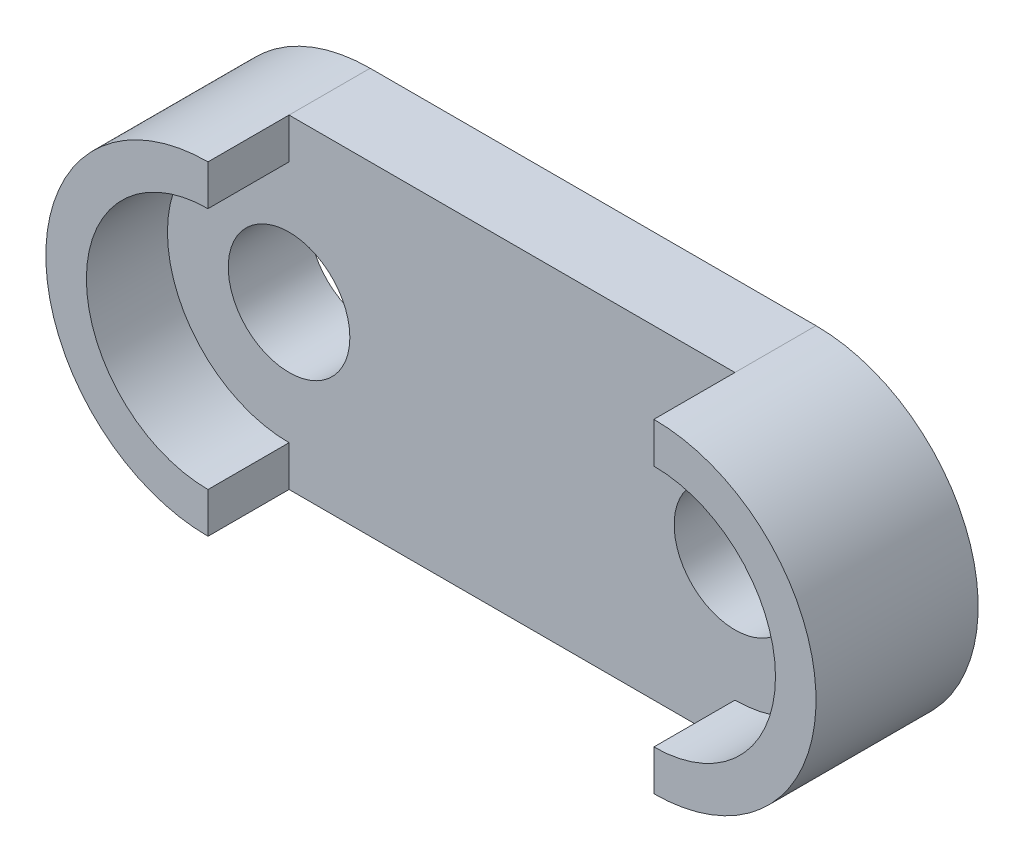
from build123d import *

# Parameters (mm, degrees)
ESQUISSE1_R          = 1.5
PRISME_DE_BASE_DEPTH = 1
EXTRU_MINCE1_START   = 2
EXTRU_MINCE1_DEPTH   = 2


with BuildPart() as part:
    # Esquisse1 → Prisme de base (new, symmetric)
    with BuildSketch(Plane.XY):
        with BuildLine():
            Line((-5.5, 4), (5.5, 4))
            ThreePointArc((5.5, 4), (9.5, 0), (5.5, -4))
            Line((5.5, -4), (-5.5, -4))
            ThreePointArc((-5.5, -4), (-9.5, 0), (-5.5, 4))
        make_face()
        with Locations((5.5, 0)):
            Circle(ESQUISSE1_R, mode=Mode.SUBTRACT)
        with Locations((-5.5, 0)):
            Circle(ESQUISSE1_R, mode=Mode.SUBTRACT)
    extrude(amount=PRISME_DE_BASE_DEPTH, both=True)

    # Esquisse2 → Extru.-Mince1 (add)
    with BuildSketch(Plane.XY.offset(1).offset(EXTRU_MINCE1_START)):
        with BuildLine():
            ThreePointArc((5.5, -4), (9.5, 0), (5.5, 4))
            Line((5.5, 4), (5.5, 3))
            ThreePointArc((5.5, 3), (8.5, 0), (5.5, -3))
            Line((5.5, -3), (5.5, -4))
        make_face()
    extru_mince1 = extrude(amount=-EXTRU_MINCE1_DEPTH)

    # Sym_trie1: Extru.-Mince1 across plane
    add(extru_mince1.mirror(Plane(origin=(0, 0, 0), x_dir=(0, 0, 1), z_dir=(1, 0, 0))))


solid = part.part
